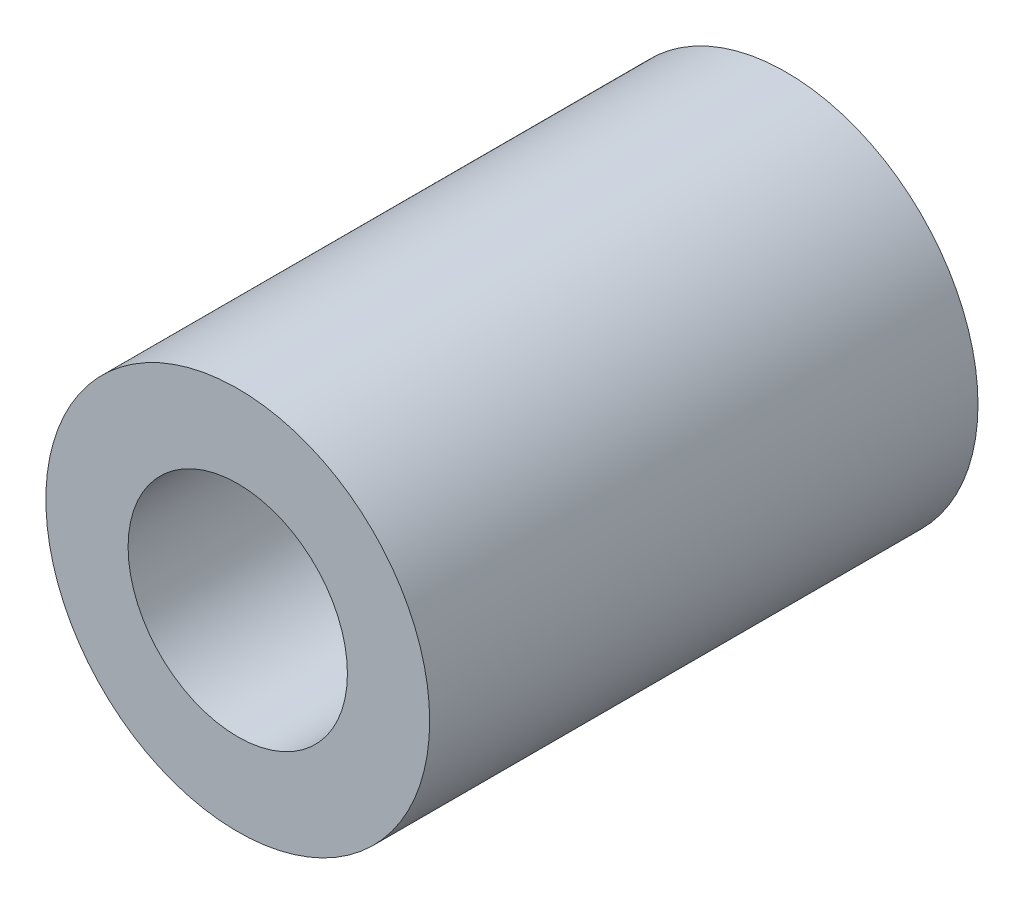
from build123d import *

# Parameters (mm, degrees)
ESQUISSE1_R        = 3.5
ESQUISSE1_R_2      = 2
BOSS_EXTRU_1_DEPTH = 10


with BuildPart() as part:
    # Esquisse1 → Boss.-Extru.1 (new body)
    with BuildSketch(Plane.XY):
        Circle(ESQUISSE1_R)
        Circle(ESQUISSE1_R_2, mode=Mode.SUBTRACT)
    extrude(amount=BOSS_EXTRU_1_DEPTH)


solid = part.part
